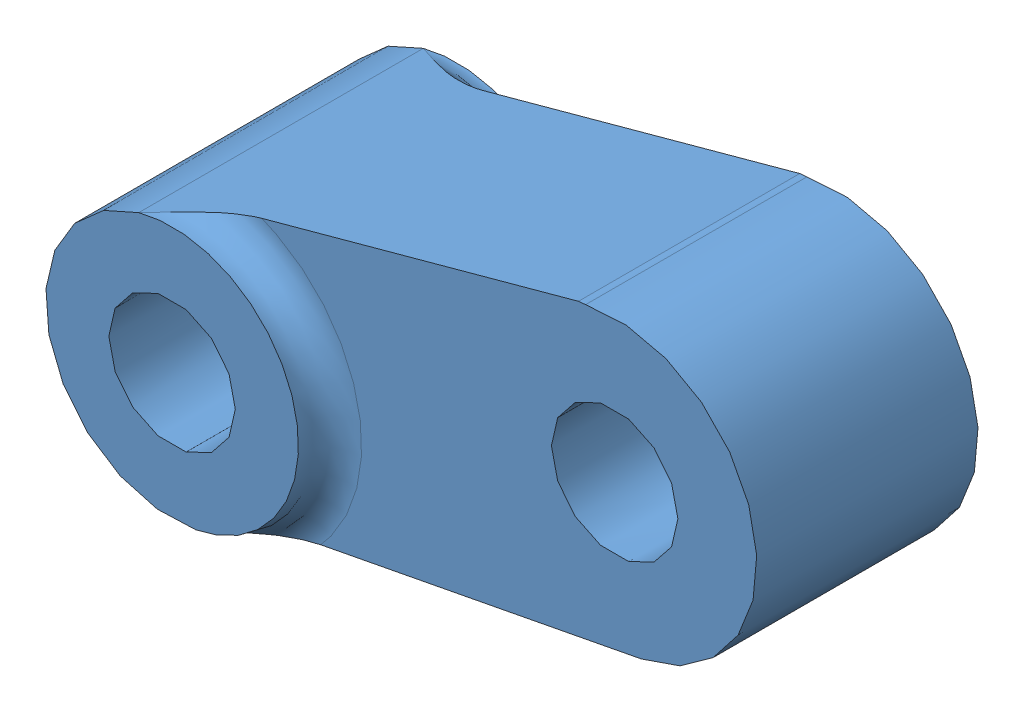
SolidWorks assembly Assemblage noix.SLDASM, configuration Défaut (file format 4400). Lengths in mm.
Overall size (43 23.3 37).
5 component instances, 4 part files, 6 mates.
Components (placement in the parent):
- noix-1: noix.SLDPRT [Défaut] at (-14.916 29.7536 0) size (43 23.3 18.89)
- vis sans tête à six pans creux à bout tronconique ISO - M6 x 6 - N-1: vis sans tête à six pans creux à bout tronconique ISO - M6 x 6 - N.SLDPRT [ISO 4027 - M5 x 6-N] at (-25.2239 2.0671 0.1157) x (0.974391 0.22486 0) z (-0.041059 0.177921 0.983188) size (6 5 5)
- Axe de la chape-1: Axe de la chape.SLDPRT [Défaut] at (-17.916 3.7536 18.6157) x (-0.974391 -0.22486 0) z (0.22486 -0.974391 0) size (8 37 8)
- Axe de la noix-1: Axe de la noix.SLDPRT [Défaut] at (8.084 9.7536 -14.5) x (0.188185 -0.982134 0) z (-0.982134 -0.188185 0) size (8 29 8)
- vis sans tête à six pans creux à bout tronconique ISO - M6 x 6 - N-2: vis sans tête à six pans creux à bout tronconique ISO - M6 x 6 - N.SLDPRT [ISO 4027 - M5 x 6-N] at (9.4954 2.3876 0) x (-0.188185 0.982134 0) z (0.377072 0.07225 0.923362) size (6 5 5)
Mates (geometry in assembly coordinates):
- Coïncidente1: coincident aligned: cone of vis sans tête à six pans creux à bout tronconique ISO - M6 x 6 - N-1 through (-21.8136 2.8541 0.1157) axis (0.974391 0.22486 0); cone of Axe de la chape-1 through (-23.0824 2.5613 0.1157) axis (0.974391 0.22486 0)
- Coaxiale2: concentric aligned: cylinder of noix-1 through (-17.916 3.7536 -7) axis (0 0 1) radius 4; cylinder of Axe de la chape-1 through (-17.916 3.7536 -18.3843) axis (0 0 1) radius 4
- Coaxiale3: concentric anti-aligned: cylinder of noix-1 through (8.084 9.7536 -7) axis (0 0 1) radius 4; cylinder of Axe de la noix-1 through (8.084 9.7536 14.5) axis (0 0 -1) radius 4
- Distance1: distance = 7.5 mm aligned: plane of Axe de la noix-1 through (8.084 9.7536 -14.5) normal (0 0 -1); plane of noix-1 through (-17.916 3.7536 -7) normal (0 0 -1)
- Parallèle1: parallel anti-aligned: cylinder of noix-1 through (5.2163 24.72 0) axis (0.188185 -0.982134 0) radius 2.5; cone of Axe de la noix-1 through (9.8345 0.6176 0) axis (-0.188185 0.982134 0)
- Coïncidente3: coincident aligned: cone of Axe de la noix-1 through (9.8345 0.6176 0) axis (-0.188185 0.982134 0); cone of vis sans tête à six pans creux à bout tronconique ISO - M6 x 6 - N-2 through (8.8367 5.8251 0) axis (-0.188185 0.982134 0)
